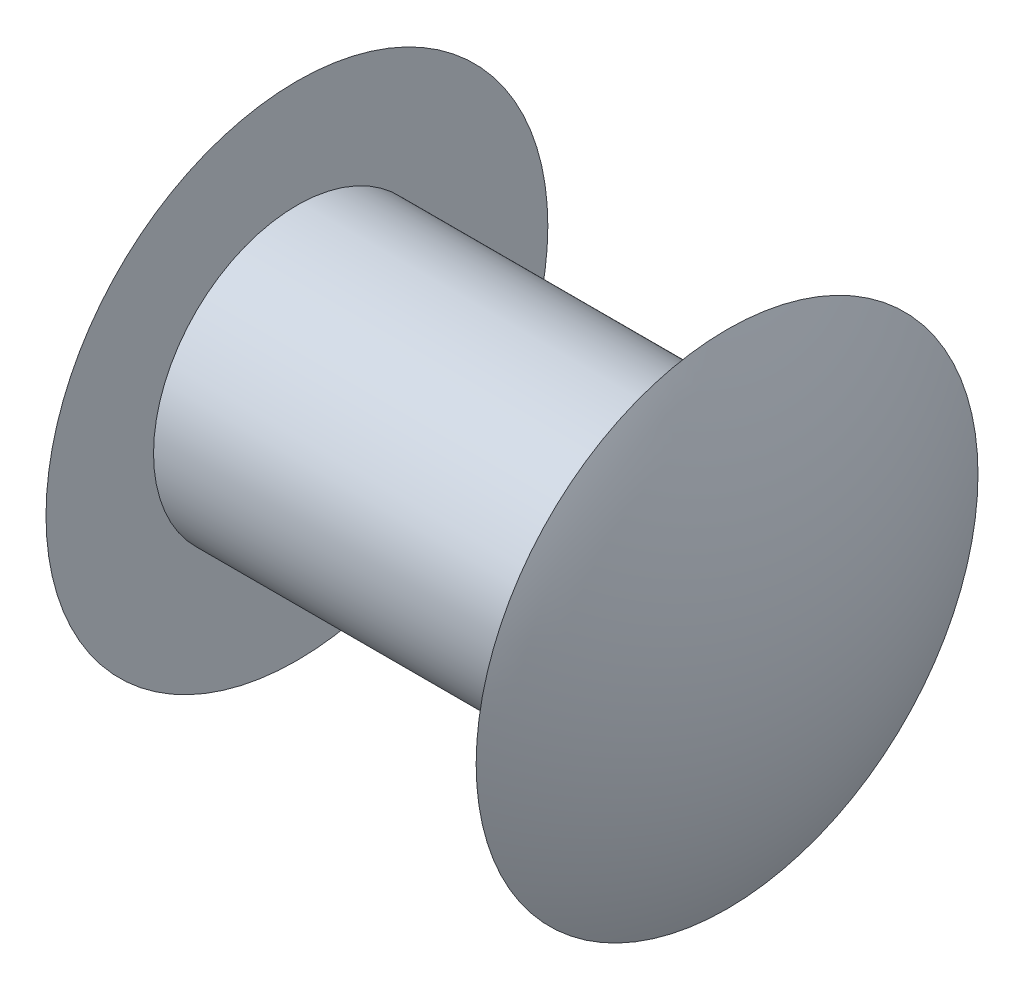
from build123d import *


with BuildPart() as part:
    # Sketch1 → Revolve1 (revolve)
    with BuildSketch(Plane.XY):
        with BuildLine():
            Line((0, 3.175), (9.525, 3.175))
            Line((9.525, 3.175), (9.525, 5.55625))
            ThreePointArc((9.525, 5.55625), (10.473457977, 2.849772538), (10.795, 0))
            Line((10.795, 0), (-1.27, 0))
            ThreePointArc((-1.27, 0), (-0.948457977, 2.849772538), (0, 5.55625))
            Line((0, 5.55625), (0, 3.175))
        make_face()
    revolve(axis=Axis((-1.27, 0, 0), (1, 0, 0)))


solid = part.part
